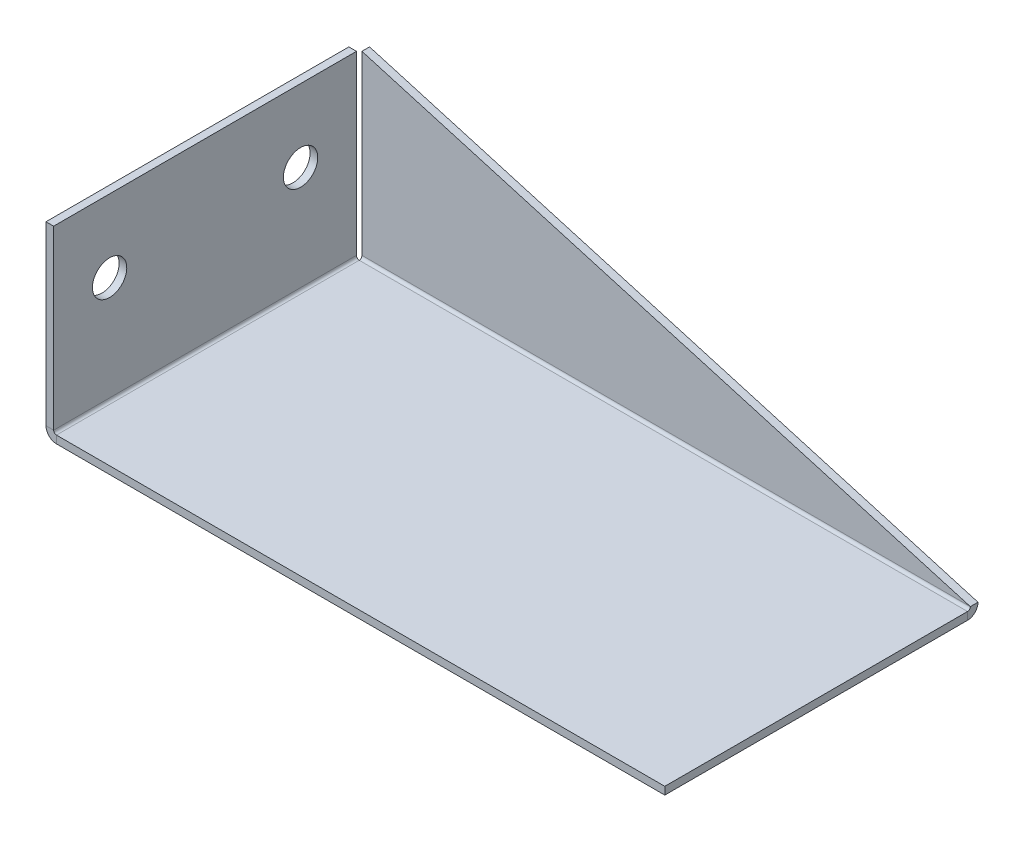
ISO-10303-21;
HEADER;
FILE_DESCRIPTION(('STEP AP214'),'2;1');
FILE_NAME('part.step','',(''),(''),'','','');
FILE_SCHEMA(('AUTOMOTIVE_DESIGN { 1 0 10303 214 1 1 1 1 }'));
ENDSEC;
DATA;
#1=APPLICATION_CONTEXT('core data for automotive mechanical design processes');
#2=APPLICATION_PROTOCOL_DEFINITION('international standard','automotive_design',2000,#1);
#3=PRODUCT_CONTEXT('',#1,'mechanical');
#4=PRODUCT('Part','Part','',(#3));
#5=PRODUCT_RELATED_PRODUCT_CATEGORY('part','',(#4));
#6=PRODUCT_DEFINITION_FORMATION('','',#4);
#7=PRODUCT_DEFINITION_CONTEXT('part definition',#1,'design');
#8=PRODUCT_DEFINITION('design','',#6,#7);
#9=PRODUCT_DEFINITION_SHAPE('','',#8);
#10=(LENGTH_UNIT() NAMED_UNIT(*) SI_UNIT(.MILLI.,.METRE.));
#11=(NAMED_UNIT(*) PLANE_ANGLE_UNIT() SI_UNIT($,.RADIAN.));
#12=(NAMED_UNIT(*) SI_UNIT($,.STERADIAN.) SOLID_ANGLE_UNIT());
#13=UNCERTAINTY_MEASURE_WITH_UNIT(LENGTH_MEASURE(1.E-05),#10,'distance_accuracy_value','');
#14=(GEOMETRIC_REPRESENTATION_CONTEXT(3) GLOBAL_UNCERTAINTY_ASSIGNED_CONTEXT((#13)) GLOBAL_UNIT_ASSIGNED_CONTEXT((#10,
#11,#12)) REPRESENTATION_CONTEXT('',''));
#15=CARTESIAN_POINT('',(0.,0.,0.));
#16=DIRECTION('',(0.,0.,1.));
#17=DIRECTION('',(1.,0.,0.));
#18=AXIS2_PLACEMENT_3D('',#15,#16,#17);
#19=CARTESIAN_POINT('',(80.,49.,-42.0000000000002));
#20=DIRECTION('',(0.,0.,1.));
#21=DIRECTION('',(0.,-1.,0.));
#22=AXIS2_PLACEMENT_3D('',#19,#20,#21);
#23=PLANE('',#22);
#24=DIRECTION('',(0.960318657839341,-0.27890513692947,0.));
#25=VECTOR('',#24,1.);
#26=CARTESIAN_POINT('',(-79.2928932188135,49.,-42.));
#27=LINE('',#26,#25);
#28=CARTESIAN_POINT('',(-79.2928932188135,49.,-42.0000000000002));
#29=VERTEX_POINT('',#28);
#30=CARTESIAN_POINT('',(79.9999999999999,2.73659999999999,-42.));
#31=VERTEX_POINT('',#30);
#32=EDGE_CURVE('E119',#29,#31,#27,.T.);
#33=ORIENTED_EDGE('',*,*,#32,.T.);
#34=DIRECTION('',(1.,0.,0.));
#35=VECTOR('',#34,1.);
#36=CARTESIAN_POINT('',(80.,2.73660000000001,-42.));
#37=LINE('',#36,#35);
#38=CARTESIAN_POINT('',(-79.2928932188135,2.73660000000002,-42.));
#39=VERTEX_POINT('',#38);
#40=EDGE_CURVE('E144',#39,#31,#37,.T.);
#41=ORIENTED_EDGE('',*,*,#40,.F.);
#42=DIRECTION('',(0.,1.,0.));
#43=VECTOR('',#42,1.);
#44=CARTESIAN_POINT('',(-79.2928932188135,49.,-42.0000000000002));
#45=LINE('',#44,#43);
#46=EDGE_CURVE('E125',#39,#29,#45,.T.);
#47=ORIENTED_EDGE('',*,*,#46,.T.);
#48=EDGE_LOOP('',(#33,#41,#47));
#49=FACE_BOUND('',#48,.T.);
#50=ADVANCED_FACE('F32',(#49),#23,.F.);
#51=CARTESIAN_POINT('',(80.,49.,-40.0000000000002));
#52=DIRECTION('',(0.,0.,1.));
#53=DIRECTION('',(0.,-1.,0.));
#54=AXIS2_PLACEMENT_3D('',#51,#52,#53);
#55=PLANE('',#54);
#56=DIRECTION('',(-1.,0.,0.));
#57=VECTOR('',#56,1.);
#58=CARTESIAN_POINT('',(80.,2.7366,-40.));
#59=LINE('',#58,#57);
#60=CARTESIAN_POINT('',(79.9999999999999,2.73659999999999,-40.));
#61=VERTEX_POINT('',#60);
#62=CARTESIAN_POINT('',(-79.2928932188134,2.73659999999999,-40.));
#63=VERTEX_POINT('',#62);
#64=EDGE_CURVE('E133',#61,#63,#59,.T.);
#65=ORIENTED_EDGE('',*,*,#64,.F.);
#66=DIRECTION('',(0.960318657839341,-0.27890513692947,0.));
#67=VECTOR('',#66,1.);
#68=CARTESIAN_POINT('',(-79.2928932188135,49.,-40.));
#69=LINE('',#68,#67);
#70=CARTESIAN_POINT('',(-79.2928932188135,49.,-40.0000000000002));
#71=VERTEX_POINT('',#70);
#72=EDGE_CURVE('E116',#71,#61,#69,.T.);
#73=ORIENTED_EDGE('',*,*,#72,.F.);
#74=DIRECTION('',(0.,1.,0.));
#75=VECTOR('',#74,1.);
#76=CARTESIAN_POINT('',(-79.2928932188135,2.,-40.));
#77=LINE('',#76,#75);
#78=EDGE_CURVE('E131',#63,#71,#77,.T.);
#79=ORIENTED_EDGE('',*,*,#78,.F.);
#80=EDGE_LOOP('',(#65,#73,#79));
#81=FACE_BOUND('',#80,.T.);
#82=ADVANCED_FACE('F130',(#81),#55,.T.);
#83=CARTESIAN_POINT('',(-80.,2.,40.));
#84=DIRECTION('',(0.,1.,0.));
#85=DIRECTION('',(0.,0.,1.));
#86=AXIS2_PLACEMENT_3D('',#83,#84,#85);
#87=PLANE('',#86);
#88=DIRECTION('',(0.,0.,-1.));
#89=VECTOR('',#88,1.);
#90=CARTESIAN_POINT('',(80.,2.,-40.));
#91=LINE('',#90,#89);
#92=CARTESIAN_POINT('',(80.,2.,40.));
#93=VERTEX_POINT('',#92);
#94=CARTESIAN_POINT('',(79.9999999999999,2.,-39.2634));
#95=VERTEX_POINT('',#94);
#96=EDGE_CURVE('E40',#93,#95,#91,.T.);
#97=ORIENTED_EDGE('',*,*,#96,.T.);
#98=DIRECTION('',(-1.,0.,0.));
#99=VECTOR('',#98,1.);
#100=CARTESIAN_POINT('',(-79.2928932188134,2.,-39.2634));
#101=LINE('',#100,#99);
#102=CARTESIAN_POINT('',(-79.2634,2.,-39.2634));
#103=VERTEX_POINT('',#102);
#104=EDGE_CURVE('E154',#103,#95,#101,.F.);
#105=ORIENTED_EDGE('',*,*,#104,.F.);
#106=DIRECTION('',(0.,0.,1.));
#107=VECTOR('',#106,1.);
#108=CARTESIAN_POINT('',(-79.2634,1.99999999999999,40.));
#109=LINE('',#108,#107);
#110=CARTESIAN_POINT('',(-79.2634,2.,40.));
#111=VERTEX_POINT('',#110);
#112=EDGE_CURVE('E47',#111,#103,#109,.F.);
#113=ORIENTED_EDGE('',*,*,#112,.F.);
#114=DIRECTION('',(1.,0.,0.));
#115=VECTOR('',#114,1.);
#116=CARTESIAN_POINT('',(-80.,2.,40.));
#117=LINE('',#116,#115);
#118=EDGE_CURVE('E51',#111,#93,#117,.T.);
#119=ORIENTED_EDGE('',*,*,#118,.T.);
#120=EDGE_LOOP('',(#97,#105,#113,#119));
#121=FACE_BOUND('',#120,.T.);
#122=ADVANCED_FACE('F265',(#121),#87,.T.);
#123=CARTESIAN_POINT('',(-80.,0.,40.));
#124=DIRECTION('',(0.,1.,0.));
#125=DIRECTION('',(0.,0.,1.));
#126=AXIS2_PLACEMENT_3D('',#123,#124,#125);
#127=PLANE('',#126);
#128=DIRECTION('',(-1.,0.,0.));
#129=VECTOR('',#128,1.);
#130=CARTESIAN_POINT('',(-79.2928932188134,0.,-39.2634));
#131=LINE('',#130,#129);
#132=CARTESIAN_POINT('',(-79.2634,0.,-39.2634));
#133=VERTEX_POINT('',#132);
#134=CARTESIAN_POINT('',(79.9999999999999,0.,-39.2634));
#135=VERTEX_POINT('',#134);
#136=EDGE_CURVE('E159',#133,#135,#131,.F.);
#137=ORIENTED_EDGE('',*,*,#136,.T.);
#138=DIRECTION('',(0.,0.,-1.));
#139=VECTOR('',#138,1.);
#140=CARTESIAN_POINT('',(80.,0.,-40.));
#141=LINE('',#140,#139);
#142=CARTESIAN_POINT('',(80.,0.,40.));
#143=VERTEX_POINT('',#142);
#144=EDGE_CURVE('E260',#143,#135,#141,.T.);
#145=ORIENTED_EDGE('',*,*,#144,.F.);
#146=DIRECTION('',(1.,0.,0.));
#147=VECTOR('',#146,1.);
#148=CARTESIAN_POINT('',(-80.,0.,40.));
#149=LINE('',#148,#147);
#150=CARTESIAN_POINT('',(-79.2633999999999,0.,40.));
#151=VERTEX_POINT('',#150);
#152=EDGE_CURVE('E258',#151,#143,#149,.T.);
#153=ORIENTED_EDGE('',*,*,#152,.F.);
#154=DIRECTION('',(0.,0.,1.));
#155=VECTOR('',#154,1.);
#156=CARTESIAN_POINT('',(-79.2633999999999,0.,40.));
#157=LINE('',#156,#155);
#158=EDGE_CURVE('E235',#151,#133,#157,.F.);
#159=ORIENTED_EDGE('',*,*,#158,.T.);
#160=EDGE_LOOP('',(#137,#145,#153,#159));
#161=FACE_BOUND('',#160,.T.);
#162=ADVANCED_FACE('F283',(#161),#127,.F.);
#163=CARTESIAN_POINT('',(80.,2.,-40.));
#164=DIRECTION('',(-1.,0.,0.));
#165=DIRECTION('',(0.,0.,1.));
#166=AXIS2_PLACEMENT_3D('',#163,#164,#165);
#167=PLANE('',#166);
#168=DIRECTION('',(0.,-1.,0.));
#169=VECTOR('',#168,1.);
#170=CARTESIAN_POINT('',(79.9999999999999,2.,-39.2634));
#171=LINE('',#170,#169);
#172=EDGE_CURVE('E158',#95,#135,#171,.T.);
#173=ORIENTED_EDGE('',*,*,#172,.F.);
#174=ORIENTED_EDGE('',*,*,#96,.F.);
#175=DIRECTION('',(0.,-1.,0.));
#176=VECTOR('',#175,1.);
#177=CARTESIAN_POINT('',(80.,2.,40.));
#178=LINE('',#177,#176);
#179=EDGE_CURVE('E11',#93,#143,#178,.T.);
#180=ORIENTED_EDGE('',*,*,#179,.T.);
#181=ORIENTED_EDGE('',*,*,#144,.T.);
#182=EDGE_LOOP('',(#173,#174,#180,#181));
#183=FACE_BOUND('',#182,.T.);
#184=ADVANCED_FACE('F337',(#183),#167,.F.);
#185=CARTESIAN_POINT('',(-80.,2.,40.));
#186=DIRECTION('',(0.,0.,-1.));
#187=DIRECTION('',(-1.,0.,0.));
#188=AXIS2_PLACEMENT_3D('',#185,#186,#187);
#189=PLANE('',#188);
#190=DIRECTION('',(0.,-1.,0.));
#191=VECTOR('',#190,1.);
#192=CARTESIAN_POINT('',(-79.2634,1.99999999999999,40.));
#193=LINE('',#192,#191);
#194=EDGE_CURVE('E247',#111,#151,#193,.T.);
#195=ORIENTED_EDGE('',*,*,#194,.T.);
#196=ORIENTED_EDGE('',*,*,#152,.T.);
#197=ORIENTED_EDGE('',*,*,#179,.F.);
#198=ORIENTED_EDGE('',*,*,#118,.F.);
#199=EDGE_LOOP('',(#195,#196,#197,#198));
#200=FACE_BOUND('',#199,.T.);
#201=ADVANCED_FACE('F34',(#200),#189,.F.);
#202=CARTESIAN_POINT('',(-79.2634,-0.0200000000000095,-39.2634));
#203=CARTESIAN_POINT('',(-79.6243031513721,-0.0200000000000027,-39.2658582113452));
#204=CARTESIAN_POINT('',(-79.9849342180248,0.0517469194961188,-39.2683155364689));
#205=CARTESIAN_POINT('',(-80.6516760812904,0.327920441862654,-39.2732310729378));
#206=CARTESIAN_POINT('',(-80.9574594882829,0.532238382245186,-39.2756888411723));
#207=CARTESIAN_POINT('',(-81.4677616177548,1.04254051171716,-39.2806043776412));
#208=CARTESIAN_POINT('',(-81.6720795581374,1.34832391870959,-39.2830621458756));
#209=CARTESIAN_POINT('',(-81.9482530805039,2.01506578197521,-39.2879776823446));
#210=CARTESIAN_POINT('',(-82.02,2.37569684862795,-39.2904350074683));
#211=CARTESIAN_POINT('',(-82.02,2.7366,-39.2928932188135));
#212=CARTESIAN_POINT('',(-79.2634,0.,-39.2634));
#213=CARTESIAN_POINT('',(-79.6216846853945,0.,-39.2658582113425));
#214=CARTESIAN_POINT('',(-79.9796992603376,0.0712263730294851,-39.2683155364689));
#215=CARTESIAN_POINT('',(-80.641603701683,0.345396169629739,-39.2732310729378));
#216=CARTESIAN_POINT('',(-80.9451685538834,0.548231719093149,-39.2756888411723));
#217=CARTESIAN_POINT('',(-81.4517682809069,1.05483144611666,-39.2806043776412));
#218=CARTESIAN_POINT('',(-81.6546038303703,1.358396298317,-39.2830621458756));
#219=CARTESIAN_POINT('',(-81.9287736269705,2.0203007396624,-39.2879776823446));
#220=CARTESIAN_POINT('',(-82.,2.37831531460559,-39.2904350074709));
#221=CARTESIAN_POINT('',(-82.,2.7366,-39.2928932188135));
#222=CARTESIAN_POINT('',(-79.2634,1.99999999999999,-39.2634));
#223=CARTESIAN_POINT('',(-79.3598380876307,1.99999999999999,-39.2658582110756));
#224=CARTESIAN_POINT('',(-79.456203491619,2.01917172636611,-39.2683155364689));
#225=CARTESIAN_POINT('',(-79.6343657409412,2.09296894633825,-39.2732310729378));
#226=CARTESIAN_POINT('',(-79.7160751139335,2.1475654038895,-39.2756888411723));
#227=CARTESIAN_POINT('',(-79.8524345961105,2.28392488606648,-39.2806043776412));
#228=CARTESIAN_POINT('',(-79.9070310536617,2.3656342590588,-39.2830621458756));
#229=CARTESIAN_POINT('',(-79.9808282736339,2.54379650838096,-39.2879776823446));
#230=CARTESIAN_POINT('',(-80.,2.64016191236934,-39.2904350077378));
#231=CARTESIAN_POINT('',(-80.,2.73660000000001,-39.2928932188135));
#232=CARTESIAN_POINT('',(-79.2634,2.02019999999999,-39.2634));
#233=CARTESIAN_POINT('',(-79.3571934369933,2.02019999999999,-39.265858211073));
#234=CARTESIAN_POINT('',(-79.450916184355,2.03884597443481,-39.2683155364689));
#235=CARTESIAN_POINT('',(-79.6241926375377,2.11061943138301,-39.2732310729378));
#236=CARTESIAN_POINT('',(-79.70366127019,2.16371867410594,-39.2756888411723));
#237=CARTESIAN_POINT('',(-79.8362813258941,2.29633872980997,-39.2806043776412));
#238=CARTESIAN_POINT('',(-79.889380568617,2.37580736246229,-39.2830621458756));
#239=CARTESIAN_POINT('',(-79.9611540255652,2.54908381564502,-39.2879776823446));
#240=CARTESIAN_POINT('',(-79.9798,2.64280656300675,-39.2904350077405));
#241=CARTESIAN_POINT('',(-79.9798,2.73660000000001,-39.2928932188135));
#242=B_SPLINE_SURFACE_WITH_KNOTS('',1,3,((#202,#203,#204,#205,#206,#207,#208,#209,#210,#211),
(#212,#213,#214,#215,#216,#217,#218,#219,#220,#221),(#222,#223,#224,#225,#226,#227,#228,#229,
#230,#231),(#232,#233,#234,#235,#236,#237,#238,#239,#240,#241)),.UNSPECIFIED.,.F.,.F.,.F.,(2,1,
1,2),(4,2,2,2,4),(-0.01,0.,1.,1.0101),(0.,0.25,0.5,0.75,1.),.UNSPECIFIED.);
#243=DIRECTION('',(1.,0.,0.));
#244=VECTOR('',#243,1.);
#245=CARTESIAN_POINT('',(-80.,2.73660000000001,-39.2928932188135));
#246=LINE('',#245,#244);
#247=CARTESIAN_POINT('',(-82.,2.7366,-39.2928932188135));
#248=VERTEX_POINT('',#247);
#249=CARTESIAN_POINT('',(-80.,2.73660000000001,-39.2928932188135));
#250=VERTEX_POINT('',#249);
#251=EDGE_CURVE('E298',#248,#250,#246,.T.);
#252=CARTESIAN_POINT('',(-79.2634,1.99999999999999,-39.2634));
#253=CARTESIAN_POINT('',(-79.275452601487,1.9999997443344,-39.2637072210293));
#254=CARTESIAN_POINT('',(-79.2875051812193,2.0002958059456,-39.2640144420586));
#255=CARTESIAN_POINT('',(-79.3115813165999,2.00147872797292,-39.2646288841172));
#256=CARTESIAN_POINT('',(-79.323604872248,2.00236558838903,-39.2649361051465));
#257=CARTESIAN_POINT('',(-79.3475939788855,2.00472827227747,-39.2655505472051));
#258=CARTESIAN_POINT('',(-79.3595595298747,2.00620409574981,-39.2658577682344));
#259=CARTESIAN_POINT('',(-79.383403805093,2.00974106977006,-39.2664722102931));
#260=CARTESIAN_POINT('',(-79.3952825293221,2.01180222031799,-39.2667794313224));
#261=CARTESIAN_POINT('',(-79.4189245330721,2.01650490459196,-39.267393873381));
#262=CARTESIAN_POINT('',(-79.4306878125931,2.019146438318,-39.2677010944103));
#263=CARTESIAN_POINT('',(-79.4540705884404,2.02500351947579,-39.2683155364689));
#264=CARTESIAN_POINT('',(-79.4656900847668,2.02821906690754,-39.2686227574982));
#265=CARTESIAN_POINT('',(-79.4887573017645,2.03521643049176,-39.2692371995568));
#266=CARTESIAN_POINT('',(-79.5002050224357,2.03899824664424,-39.2695444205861));
#267=CARTESIAN_POINT('',(-79.5229011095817,2.04711903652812,-39.2701588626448));
#268=CARTESIAN_POINT('',(-79.5341494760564,2.05145801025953,-39.2704660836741));
#269=CARTESIAN_POINT('',(-79.5564197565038,2.06068266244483,-39.2710805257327));
#270=CARTESIAN_POINT('',(-79.5674416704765,2.06556834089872,-39.271387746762));
#271=CARTESIAN_POINT('',(-79.589232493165,2.07587463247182,-39.2720021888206));
#272=CARTESIAN_POINT('',(-79.6000014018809,2.08129524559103,-39.2723094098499));
#273=CARTESIAN_POINT('',(-79.6212602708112,2.09265834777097,-39.2729238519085));
#274=CARTESIAN_POINT('',(-79.6317502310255,2.0986008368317,-39.2732310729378));
#275=CARTESIAN_POINT('',(-79.6524259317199,2.11099337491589,-39.2738455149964));
#276=CARTESIAN_POINT('',(-79.6626116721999,2.11744342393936,-39.2741527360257));
#277=CARTESIAN_POINT('',(-79.6826543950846,2.13083554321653,-39.2747671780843));
#278=CARTESIAN_POINT('',(-79.6925113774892,2.13777761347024,-39.2750743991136));
#279=CARTESIAN_POINT('',(-79.7118728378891,2.15213705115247,-39.2756888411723));
#280=CARTESIAN_POINT('',(-79.7213773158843,2.15955441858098,-39.2759960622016));
#281=CARTESIAN_POINT('',(-79.7400108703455,2.17484658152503,-39.2766105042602));
#282=CARTESIAN_POINT('',(-79.7491399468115,2.18272137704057,-39.2769177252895));
#283=CARTESIAN_POINT('',(-79.7670007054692,2.1989094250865,-39.2775321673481));
#284=CARTESIAN_POINT('',(-79.7757323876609,2.2072226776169,-39.2778393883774));
#285=CARTESIAN_POINT('',(-79.7927773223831,2.22426761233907,-39.278453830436));
#286=CARTESIAN_POINT('',(-79.8010905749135,2.23299929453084,-39.2787610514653));
#287=CARTESIAN_POINT('',(-79.8172786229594,2.25086005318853,-39.279375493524));
#288=CARTESIAN_POINT('',(-79.825153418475,2.25998912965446,-39.2796827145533));
#289=CARTESIAN_POINT('',(-79.840445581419,2.27862268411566,-39.2802971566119));
#290=CARTESIAN_POINT('',(-79.8478629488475,2.28812716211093,-39.2806043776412));
#291=CARTESIAN_POINT('',(-79.8622223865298,2.30748862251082,-39.2812188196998));
#292=CARTESIAN_POINT('',(-79.8691644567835,2.31734560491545,-39.2815260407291));
#293=CARTESIAN_POINT('',(-79.8825565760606,2.33738832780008,-39.2821404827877));
#294=CARTESIAN_POINT('',(-79.8890066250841,2.34757406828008,-39.282447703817));
#295=CARTESIAN_POINT('',(-79.9013991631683,2.36824976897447,-39.2830621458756));
#296=CARTESIAN_POINT('',(-79.907341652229,2.37873972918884,-39.2833693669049));
#297=CARTESIAN_POINT('',(-79.918704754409,2.3999985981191,-39.2839838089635));
#298=CARTESIAN_POINT('',(-79.9241253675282,2.41076750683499,-39.2842910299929));
#299=CARTESIAN_POINT('',(-79.9344316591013,2.43255832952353,-39.2849054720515));
#300=CARTESIAN_POINT('',(-79.9393173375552,2.44358024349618,-39.2852126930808));
#301=CARTESIAN_POINT('',(-79.9485419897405,2.46585052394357,-39.2858271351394));
#302=CARTESIAN_POINT('',(-79.9528809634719,2.4770988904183,-39.2861343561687));
#303=CARTESIAN_POINT('',(-79.9610017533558,2.49979497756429,-39.2867487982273));
#304=CARTESIAN_POINT('',(-79.9647835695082,2.51124269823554,-39.2870560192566));
#305=CARTESIAN_POINT('',(-79.9717809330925,2.53430991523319,-39.2876704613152));
#306=CARTESIAN_POINT('',(-79.9749964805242,2.54592941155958,-39.2879776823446));
#307=CARTESIAN_POINT('',(-79.980853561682,2.56931218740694,-39.2885921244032));
#308=CARTESIAN_POINT('',(-79.983495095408,2.5810754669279,-39.2888993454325));
#309=CARTESIAN_POINT('',(-79.988197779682,2.60471747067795,-39.2895137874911));
#310=CARTESIAN_POINT('',(-79.9902589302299,2.61659619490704,-39.2898210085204));
#311=CARTESIAN_POINT('',(-79.9937959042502,2.64044047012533,-39.290435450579));
#312=CARTESIAN_POINT('',(-79.9952717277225,2.65240602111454,-39.2907426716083));
#313=CARTESIAN_POINT('',(-79.997634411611,2.67639512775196,-39.2913571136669));
#314=CARTESIAN_POINT('',(-79.9985212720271,2.68841868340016,-39.2916643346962));
#315=CARTESIAN_POINT('',(-79.9997041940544,2.7124948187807,-39.2922787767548));
#316=CARTESIAN_POINT('',(-80.0000002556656,2.72454739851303,-39.2925859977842));
#317=CARTESIAN_POINT('',(-80.,2.73660000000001,-39.2928932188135));
#318=B_SPLINE_CURVE_WITH_KNOTS('',3,(#252,#253,#254,#255,#256,#257,#258,#259,#260,#261,#262,
#263,#264,#265,#266,#267,#268,#269,#270,#271,#272,#273,#274,#275,#276,#277,#278,#279,#280,#281,
#282,#283,#284,#285,#286,#287,#288,#289,#290,#291,#292,#293,#294,#295,#296,#297,#298,#299,#300,
#301,#302,#303,#304,#305,#306,#307,#308,#309,#310,#311,#312,#313,#314,#315,#316,#317),
.UNSPECIFIED.,.F.,.F.,(4,2,2,2,2,2,2,2,2,2,2,2,2,2,2,2,2,2,2,2,2,2,2,2,2,2,2,2,2,2,2,2,4),(0.,
0.0361658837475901,0.0723317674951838,0.108497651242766,0.144663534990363,0.18082941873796,
0.216995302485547,0.253161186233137,0.28932706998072,0.325492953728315,0.361658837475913,
0.397824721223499,0.433990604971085,0.470156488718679,0.506322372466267,0.542488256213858,
0.578654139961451,0.614820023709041,0.650985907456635,0.687151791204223,0.723317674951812,
0.759483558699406,0.795649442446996,0.831815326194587,0.867981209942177,0.904147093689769,
0.940312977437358,0.976478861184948,1.01264474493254,1.04881062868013,1.08497651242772,
1.12114239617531,1.1573082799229),.UNSPECIFIED.);
#319=EDGE_CURVE('E228',#103,#250,#318,.T.);
#320=DIRECTION('',(0.,-1.,0.));
#321=VECTOR('',#320,1.);
#322=CARTESIAN_POINT('',(-79.2634,1.99999999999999,-39.2634));
#323=LINE('',#322,#321);
#324=EDGE_CURVE('E255',#103,#133,#323,.T.);
#325=CARTESIAN_POINT('',(-79.2634,0.,-39.2634));
#326=CARTESIAN_POINT('',(-79.3081775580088,-9.49843149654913E-07,-39.2637072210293));
#327=CARTESIAN_POINT('',(-79.3529550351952,0.00109897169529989,-39.2640144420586));
#328=CARTESIAN_POINT('',(-79.4424021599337,0.00549373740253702,-39.2646288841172));
#329=CARTESIAN_POINT('',(-79.4870718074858,0.00878858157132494,-39.2649361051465));
#330=CARTESIAN_POINT('',(-79.576195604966,0.017566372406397,-39.2655505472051));
#331=CARTESIAN_POINT('',(-79.6206497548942,0.0230493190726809,-39.2658577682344));
#332=CARTESIAN_POINT('',(-79.709235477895,0.0361898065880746,-39.2664722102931));
#333=CARTESIAN_POINT('',(-79.7533670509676,0.0438473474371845,-39.2667794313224));
#334=CARTESIAN_POINT('',(-79.8412012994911,0.061318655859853,-39.267393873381));
#335=CARTESIAN_POINT('',(-79.8849039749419,0.0711324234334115,-39.2677010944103));
#336=CARTESIAN_POINT('',(-79.9717751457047,0.0928925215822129,-39.2683155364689));
#337=CARTESIAN_POINT('',(-80.0149436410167,0.104838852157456,-39.2686227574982));
#338=CARTESIAN_POINT('',(-80.1006424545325,0.130835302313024,-39.2692371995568));
#339=CARTESIAN_POINT('',(-80.1431727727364,0.14488542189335,-39.2695444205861));
#340=CARTESIAN_POINT('',(-80.22749277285,0.175055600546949,-39.2701588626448));
#341=CARTESIAN_POINT('',(-80.2692824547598,0.191175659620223,-39.2704660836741));
#342=CARTESIAN_POINT('',(-80.3520205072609,0.225446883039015,-39.2710805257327));
#343=CARTESIAN_POINT('',(-80.3929688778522,0.243598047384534,-39.271387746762));
#344=CARTESIAN_POINT('',(-80.4739256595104,0.281887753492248,-39.2720021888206));
#345=CARTESIAN_POINT('',(-80.5139340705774,0.302026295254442,-39.2723094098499));
#346=CARTESIAN_POINT('',(-80.5929145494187,0.344242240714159,-39.2729238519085));
#347=CARTESIAN_POINT('',(-80.6318866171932,0.366319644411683,-39.2732310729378));
#348=CARTESIAN_POINT('',(-80.7087005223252,0.412360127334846,-39.2738455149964));
#349=CARTESIAN_POINT('',(-80.7465423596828,0.436323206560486,-39.2741527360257));
#350=CARTESIAN_POINT('',(-80.8210046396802,0.486077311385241,-39.2747671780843));
#351=CARTESIAN_POINT('',(-80.85762508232,0.511868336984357,-39.2750743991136));
#352=CARTESIAN_POINT('',(-80.929556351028,0.565216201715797,-39.2756888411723));
#353=CARTESIAN_POINT('',(-80.9648671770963,0.592773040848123,-39.2759960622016));
#354=CARTESIAN_POINT('',(-81.0340941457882,0.649586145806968,-39.2766105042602));
#355=CARTESIAN_POINT('',(-81.068010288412,0.678842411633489,-39.2769177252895));
#356=CARTESIAN_POINT('',(-81.1343661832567,0.738983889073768,-39.2775321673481));
#357=CARTESIAN_POINT('',(-81.1668059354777,0.769869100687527,-39.2778393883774));
#358=CARTESIAN_POINT('',(-81.2301308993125,0.833194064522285,-39.278453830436));
#359=CARTESIAN_POINT('',(-81.2610161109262,0.865633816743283,-39.2787610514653));
#360=CARTESIAN_POINT('',(-81.3211575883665,0.931989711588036,-39.279375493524));
#361=CARTESIAN_POINT('',(-81.3504138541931,0.965905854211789,-39.2796827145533));
#362=CARTESIAN_POINT('',(-81.4072269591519,1.03513282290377,-39.2802971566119));
#363=CARTESIAN_POINT('',(-81.4347837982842,1.07044364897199,-39.2806043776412));
#364=CARTESIAN_POINT('',(-81.4881316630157,1.14237491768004,-39.2812188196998));
#365=CARTESIAN_POINT('',(-81.5139226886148,1.17899536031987,-39.2815260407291));
#366=CARTESIAN_POINT('',(-81.5636767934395,1.25345764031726,-39.2821404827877));
#367=CARTESIAN_POINT('',(-81.5876398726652,1.29129947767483,-39.282447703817));
#368=CARTESIAN_POINT('',(-81.6336803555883,1.36811338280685,-39.2830621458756));
#369=CARTESIAN_POINT('',(-81.6557577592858,1.4070854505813,-39.2833693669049));
#370=CARTESIAN_POINT('',(-81.6979737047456,1.48606592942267,-39.2839838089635));
#371=CARTESIAN_POINT('',(-81.7181122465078,1.52607434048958,-39.2842910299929));
#372=CARTESIAN_POINT('',(-81.7564019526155,1.60703112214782,-39.2849054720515));
#373=CARTESIAN_POINT('',(-81.774553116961,1.64797949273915,-39.2852126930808));
#374=CARTESIAN_POINT('',(-81.8088243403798,1.73071754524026,-39.2858271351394));
#375=CARTESIAN_POINT('',(-81.8249443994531,1.77250722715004,-39.2861343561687));
#376=CARTESIAN_POINT('',(-81.8551145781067,1.85682722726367,-39.2867487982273));
#377=CARTESIAN_POINT('',(-81.869164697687,1.89935754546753,-39.2870560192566));
#378=CARTESIAN_POINT('',(-81.8951611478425,1.98505635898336,-39.2876704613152));
#379=CARTESIAN_POINT('',(-81.9071074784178,2.02822485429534,-39.2879776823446));
#380=CARTESIAN_POINT('',(-81.9288675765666,2.11509602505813,-39.2885921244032));
#381=CARTESIAN_POINT('',(-81.9386813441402,2.15879870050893,-39.2888993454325));
#382=CARTESIAN_POINT('',(-81.9561526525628,2.2466329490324,-39.2895137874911));
#383=CARTESIAN_POINT('',(-81.9638101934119,2.29076452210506,-39.2898210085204));
#384=CARTESIAN_POINT('',(-81.9769506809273,2.37935024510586,-39.290435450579));
#385=CARTESIAN_POINT('',(-81.9824336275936,2.42380439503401,-39.2907426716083));
#386=CARTESIAN_POINT('',(-81.9912114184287,2.51292819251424,-39.2913571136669));
#387=CARTESIAN_POINT('',(-81.9945062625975,2.55759784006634,-39.2916643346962));
#388=CARTESIAN_POINT('',(-81.9989010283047,2.64704496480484,-39.2922787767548));
#389=CARTESIAN_POINT('',(-82.0000009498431,2.69182244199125,-39.2925859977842));
#390=CARTESIAN_POINT('',(-82.,2.7366,-39.2928932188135));
#391=B_SPLINE_CURVE_WITH_KNOTS('',3,(#325,#326,#327,#328,#329,#330,#331,#332,#333,#334,#335,
#336,#337,#338,#339,#340,#341,#342,#343,#344,#345,#346,#347,#348,#349,#350,#351,#352,#353,#354,
#355,#356,#357,#358,#359,#360,#361,#362,#363,#364,#365,#366,#367,#368,#369,#370,#371,#372,#373,
#374,#375,#376,#377,#378,#379,#380,#381,#382,#383,#384,#385,#386,#387,#388,#389,#390),
.UNSPECIFIED.,.F.,.F.,(4,2,2,2,2,2,2,2,2,2,2,2,2,2,2,2,2,2,2,2,2,2,2,2,2,2,2,2,2,2,2,2,4),(0.,
0.134322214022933,0.268644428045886,0.402966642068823,0.537288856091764,0.671611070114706,
0.805933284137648,0.940255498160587,1.07457771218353,1.20889992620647,1.34322214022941,
1.47754435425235,1.6118665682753,1.74618878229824,1.88051099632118,2.01483321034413,
2.14915542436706,2.28347763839,2.41779985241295,2.55212206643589,2.68644428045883,
2.82076649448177,2.95508870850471,3.08941092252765,3.22373313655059,3.35805535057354,
3.49237756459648,3.62669977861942,3.76102199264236,3.8953442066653,4.02966642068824,
4.16398863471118,4.29831084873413),.UNSPECIFIED.);
#392=EDGE_CURVE('E243',#133,#248,#391,.T.);
#393=ORIENTED_EDGE('',*,*,#251,.T.);
#394=ORIENTED_EDGE('',*,*,#319,.F.);
#395=ORIENTED_EDGE('',*,*,#324,.T.);
#396=ORIENTED_EDGE('',*,*,#392,.T.);
#397=EDGE_LOOP('',(#393,#394,#395,#396));
#398=FACE_BOUND('',#397,.T.);
#399=ADVANCED_FACE('F279',(#398),#242,.F.);
#400=CARTESIAN_POINT('',(-79.2634,2.73660000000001,40.));
#401=DIRECTION('',(0.,0.,-1.));
#402=DIRECTION('',(-1.,0.,0.));
#403=AXIS2_PLACEMENT_3D('',#400,#401,#402);
#404=PLANE('',#403);
#405=CARTESIAN_POINT('',(-79.2634,2.73660000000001,40.));
#406=DIRECTION('',(0.,0.,1.));
#407=DIRECTION('',(1.,0.,0.));
#408=AXIS2_PLACEMENT_3D('',#405,#406,#407);
#409=CIRCLE('',#408,0.736600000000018);
#410=CARTESIAN_POINT('',(-80.,2.73660000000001,40.));
#411=VERTEX_POINT('',#410);
#412=EDGE_CURVE('E296',#411,#111,#409,.T.);
#413=ORIENTED_EDGE('',*,*,#412,.F.);
#414=DIRECTION('',(-1.,0.,0.));
#415=VECTOR('',#414,1.);
#416=CARTESIAN_POINT('',(-80.,2.73660000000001,40.));
#417=LINE('',#416,#415);
#418=CARTESIAN_POINT('',(-82.,2.7366,40.));
#419=VERTEX_POINT('',#418);
#420=EDGE_CURVE('E293',#411,#419,#417,.T.);
#421=ORIENTED_EDGE('',*,*,#420,.T.);
#422=CARTESIAN_POINT('',(-79.2634,2.73660000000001,40.));
#423=DIRECTION('',(0.,0.,1.));
#424=DIRECTION('',(1.,0.,0.));
#425=AXIS2_PLACEMENT_3D('',#422,#423,#424);
#426=CIRCLE('',#425,2.73660000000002);
#427=EDGE_CURVE('E233',#419,#151,#426,.T.);
#428=ORIENTED_EDGE('',*,*,#427,.T.);
#429=ORIENTED_EDGE('',*,*,#194,.F.);
#430=EDGE_LOOP('',(#413,#421,#428,#429));
#431=FACE_BOUND('',#430,.T.);
#432=ADVANCED_FACE('F224',(#431),#404,.F.);
#433=CARTESIAN_POINT('',(-79.2634,2.73660000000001,40.));
#434=DIRECTION('',(0.,0.,1.));
#435=DIRECTION('',(-1.,0.,0.));
#436=AXIS2_PLACEMENT_3D('',#433,#434,#435);
#437=CYLINDRICAL_SURFACE('',#436,2.73660000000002);
#438=ORIENTED_EDGE('',*,*,#158,.F.);
#439=ORIENTED_EDGE('',*,*,#427,.F.);
#440=DIRECTION('',(0.,0.,-1.));
#441=VECTOR('',#440,1.);
#442=CARTESIAN_POINT('',(-82.,2.7366,-40.));
#443=LINE('',#442,#441);
#444=EDGE_CURVE('E313',#419,#248,#443,.T.);
#445=ORIENTED_EDGE('',*,*,#444,.T.);
#446=ORIENTED_EDGE('',*,*,#392,.F.);
#447=EDGE_LOOP('',(#438,#439,#445,#446));
#448=FACE_BOUND('',#447,.T.);
#449=ADVANCED_FACE('F222',(#448),#437,.T.);
#450=CARTESIAN_POINT('',(-79.2634,2.73660000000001,40.));
#451=DIRECTION('',(0.,0.,1.));
#452=DIRECTION('',(-1.,0.,0.));
#453=AXIS2_PLACEMENT_3D('',#450,#451,#452);
#454=CYLINDRICAL_SURFACE('',#453,0.736600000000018);
#455=ORIENTED_EDGE('',*,*,#112,.T.);
#456=ORIENTED_EDGE('',*,*,#319,.T.);
#457=DIRECTION('',(0.,0.,1.));
#458=VECTOR('',#457,1.);
#459=CARTESIAN_POINT('',(-80.,2.73660000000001,-40.));
#460=LINE('',#459,#458);
#461=EDGE_CURVE('E316',#250,#411,#460,.T.);
#462=ORIENTED_EDGE('',*,*,#461,.T.);
#463=ORIENTED_EDGE('',*,*,#412,.T.);
#464=EDGE_LOOP('',(#455,#456,#462,#463));
#465=FACE_BOUND('',#464,.T.);
#466=ADVANCED_FACE('F203',(#465),#454,.F.);
#467=CARTESIAN_POINT('',(-80.,2.,-39.2928932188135));
#468=DIRECTION('',(0.,0.,-1.));
#469=DIRECTION('',(0.,1.,0.));
#470=AXIS2_PLACEMENT_3D('',#467,#468,#469);
#471=PLANE('',#470);
#472=DIRECTION('',(0.,1.,0.));
#473=VECTOR('',#472,1.);
#474=CARTESIAN_POINT('',(-82.0000000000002,49.,-39.2928932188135));
#475=LINE('',#474,#473);
#476=CARTESIAN_POINT('',(-82.0000000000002,49.,-39.2928932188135));
#477=VERTEX_POINT('',#476);
#478=EDGE_CURVE('E320',#248,#477,#475,.T.);
#479=ORIENTED_EDGE('',*,*,#478,.T.);
#480=DIRECTION('',(1.,0.,0.));
#481=VECTOR('',#480,1.);
#482=CARTESIAN_POINT('',(-82.0000000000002,49.,-39.2928932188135));
#483=LINE('',#482,#481);
#484=CARTESIAN_POINT('',(-80.0000000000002,49.,-39.2928932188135));
#485=VERTEX_POINT('',#484);
#486=EDGE_CURVE('E318',#477,#485,#483,.T.);
#487=ORIENTED_EDGE('',*,*,#486,.T.);
#488=DIRECTION('',(0.,1.,0.));
#489=VECTOR('',#488,1.);
#490=CARTESIAN_POINT('',(-80.,2.,-39.2928932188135));
#491=LINE('',#490,#489);
#492=EDGE_CURVE('E322',#250,#485,#491,.T.);
#493=ORIENTED_EDGE('',*,*,#492,.F.);
#494=ORIENTED_EDGE('',*,*,#251,.F.);
#495=EDGE_LOOP('',(#479,#487,#493,#494));
#496=FACE_BOUND('',#495,.T.);
#497=ADVANCED_FACE('F194',(#496),#471,.T.);
#498=CARTESIAN_POINT('',(-82.0000000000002,49.,-40.));
#499=DIRECTION('',(1.,0.,0.));
#500=DIRECTION('',(0.,1.,0.));
#501=AXIS2_PLACEMENT_3D('',#498,#499,#500);
#502=PLANE('',#501);
#503=CARTESIAN_POINT('',(-82.0000000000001,30.,-24.6464466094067));
#504=DIRECTION('',(1.,0.,0.));
#505=DIRECTION('',(0.,1.,0.));
#506=AXIS2_PLACEMENT_3D('',#503,#504,#505);
#507=CIRCLE('',#506,4.50000000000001);
#508=CARTESIAN_POINT('',(-82.0000000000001,34.5,-24.6464466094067));
#509=VERTEX_POINT('',#508);
#510=EDGE_CURVE('E369',#509,#509,#507,.T.);
#511=ORIENTED_EDGE('',*,*,#510,.T.);
#512=EDGE_LOOP('',(#511));
#513=FACE_BOUND('',#512,.T.);
#514=CARTESIAN_POINT('',(-82.0000000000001,30.,25.3535533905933));
#515=DIRECTION('',(1.,0.,0.));
#516=DIRECTION('',(0.,1.,0.));
#517=AXIS2_PLACEMENT_3D('',#514,#515,#516);
#518=CIRCLE('',#517,4.50000000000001);
#519=CARTESIAN_POINT('',(-82.0000000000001,34.5,25.3535533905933));
#520=VERTEX_POINT('',#519);
#521=EDGE_CURVE('E134',#520,#520,#518,.T.);
#522=ORIENTED_EDGE('',*,*,#521,.T.);
#523=EDGE_LOOP('',(#522));
#524=FACE_BOUND('',#523,.T.);
#525=ORIENTED_EDGE('',*,*,#478,.F.);
#526=ORIENTED_EDGE('',*,*,#444,.F.);
#527=DIRECTION('',(0.,1.,0.));
#528=VECTOR('',#527,1.);
#529=CARTESIAN_POINT('',(-82.0000000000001,49.,40.));
#530=LINE('',#529,#528);
#531=CARTESIAN_POINT('',(-82.0000000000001,49.,40.));
#532=VERTEX_POINT('',#531);
#533=EDGE_CURVE('E306',#419,#532,#530,.T.);
#534=ORIENTED_EDGE('',*,*,#533,.T.);
#535=DIRECTION('',(0.,0.,-1.));
#536=VECTOR('',#535,1.);
#537=CARTESIAN_POINT('',(-82.0000000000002,49.,-40.));
#538=LINE('',#537,#536);
#539=EDGE_CURVE('E303',#532,#477,#538,.T.);
#540=ORIENTED_EDGE('',*,*,#539,.T.);
#541=EDGE_LOOP('',(#525,#526,#534,#540));
#542=FACE_BOUND('',#541,.T.);
#543=ADVANCED_FACE('F202',(#513,#524,#542),#502,.F.);
#544=CARTESIAN_POINT('',(-80.0000000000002,49.,-40.));
#545=DIRECTION('',(1.,0.,0.));
#546=DIRECTION('',(0.,1.,0.));
#547=AXIS2_PLACEMENT_3D('',#544,#545,#546);
#548=PLANE('',#547);
#549=CARTESIAN_POINT('',(-80.0000000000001,30.,-24.6464466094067));
#550=DIRECTION('',(1.,0.,0.));
#551=DIRECTION('',(0.,1.,0.));
#552=AXIS2_PLACEMENT_3D('',#549,#550,#551);
#553=CIRCLE('',#552,4.50000000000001);
#554=CARTESIAN_POINT('',(-80.0000000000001,34.5,-24.6464466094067));
#555=VERTEX_POINT('',#554);
#556=EDGE_CURVE('E372',#555,#555,#553,.T.);
#557=ORIENTED_EDGE('',*,*,#556,.F.);
#558=EDGE_LOOP('',(#557));
#559=FACE_BOUND('',#558,.T.);
#560=CARTESIAN_POINT('',(-80.0000000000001,30.,25.3535533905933));
#561=DIRECTION('',(1.,0.,0.));
#562=DIRECTION('',(0.,1.,0.));
#563=AXIS2_PLACEMENT_3D('',#560,#561,#562);
#564=CIRCLE('',#563,4.50000000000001);
#565=CARTESIAN_POINT('',(-80.0000000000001,34.5,25.3535533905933));
#566=VERTEX_POINT('',#565);
#567=EDGE_CURVE('E374',#566,#566,#564,.T.);
#568=ORIENTED_EDGE('',*,*,#567,.F.);
#569=EDGE_LOOP('',(#568));
#570=FACE_BOUND('',#569,.T.);
#571=ORIENTED_EDGE('',*,*,#461,.F.);
#572=ORIENTED_EDGE('',*,*,#492,.T.);
#573=DIRECTION('',(0.,0.,-1.));
#574=VECTOR('',#573,1.);
#575=CARTESIAN_POINT('',(-80.0000000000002,49.,-40.));
#576=LINE('',#575,#574);
#577=CARTESIAN_POINT('',(-80.0000000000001,49.,40.));
#578=VERTEX_POINT('',#577);
#579=EDGE_CURVE('E308',#578,#485,#576,.T.);
#580=ORIENTED_EDGE('',*,*,#579,.F.);
#581=DIRECTION('',(0.,1.,0.));
#582=VECTOR('',#581,1.);
#583=CARTESIAN_POINT('',(-80.0000000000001,49.,40.));
#584=LINE('',#583,#582);
#585=EDGE_CURVE('E311',#411,#578,#584,.T.);
#586=ORIENTED_EDGE('',*,*,#585,.F.);
#587=EDGE_LOOP('',(#571,#572,#580,#586));
#588=FACE_BOUND('',#587,.T.);
#589=ADVANCED_FACE('F205',(#559,#570,#588),#548,.T.);
#590=CARTESIAN_POINT('',(-82.0000000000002,49.,-40.));
#591=DIRECTION('',(0.,-1.,0.));
#592=DIRECTION('',(1.,0.,0.));
#593=AXIS2_PLACEMENT_3D('',#590,#591,#592);
#594=PLANE('',#593);
#595=ORIENTED_EDGE('',*,*,#486,.F.);
#596=ORIENTED_EDGE('',*,*,#539,.F.);
#597=DIRECTION('',(1.,0.,0.));
#598=VECTOR('',#597,1.);
#599=CARTESIAN_POINT('',(-82.0000000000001,49.,40.));
#600=LINE('',#599,#598);
#601=EDGE_CURVE('E300',#532,#578,#600,.T.);
#602=ORIENTED_EDGE('',*,*,#601,.T.);
#603=ORIENTED_EDGE('',*,*,#579,.T.);
#604=EDGE_LOOP('',(#595,#596,#602,#603));
#605=FACE_BOUND('',#604,.T.);
#606=ADVANCED_FACE('F208',(#605),#594,.F.);
#607=CARTESIAN_POINT('',(-82.0000000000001,49.,40.));
#608=DIRECTION('',(0.,0.,-1.));
#609=DIRECTION('',(-1.,0.,0.));
#610=AXIS2_PLACEMENT_3D('',#607,#608,#609);
#611=PLANE('',#610);
#612=ORIENTED_EDGE('',*,*,#420,.F.);
#613=ORIENTED_EDGE('',*,*,#585,.T.);
#614=ORIENTED_EDGE('',*,*,#601,.F.);
#615=ORIENTED_EDGE('',*,*,#533,.F.);
#616=EDGE_LOOP('',(#612,#613,#614,#615));
#617=FACE_BOUND('',#616,.T.);
#618=ADVANCED_FACE('F187',(#617),#611,.F.);
#619=CARTESIAN_POINT('',(80.,2.7366,-39.2634));
#620=DIRECTION('',(1.,0.,0.));
#621=DIRECTION('',(0.,0.,-1.));
#622=AXIS2_PLACEMENT_3D('',#619,#620,#621);
#623=PLANE('',#622);
#624=DIRECTION('',(0.,0.,-1.));
#625=VECTOR('',#624,1.);
#626=CARTESIAN_POINT('',(80.,2.7366,-40.));
#627=LINE('',#626,#625);
#628=EDGE_CURVE('E124',#61,#31,#627,.T.);
#629=ORIENTED_EDGE('',*,*,#628,.F.);
#630=CARTESIAN_POINT('',(80.,2.7366,-39.2634));
#631=DIRECTION('',(-1.,0.,0.));
#632=DIRECTION('',(0.,0.,1.));
#633=AXIS2_PLACEMENT_3D('',#630,#631,#632);
#634=CIRCLE('',#633,0.736599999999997);
#635=EDGE_CURVE('E150',#95,#61,#634,.F.);
#636=ORIENTED_EDGE('',*,*,#635,.F.);
#637=ORIENTED_EDGE('',*,*,#172,.T.);
#638=CARTESIAN_POINT('',(79.9999999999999,2.7366,-39.2634));
#639=DIRECTION('',(-1.,0.,0.));
#640=DIRECTION('',(0.,0.,1.));
#641=AXIS2_PLACEMENT_3D('',#638,#639,#640);
#642=CIRCLE('',#641,2.7366);
#643=EDGE_CURVE('E155',#135,#31,#642,.F.);
#644=ORIENTED_EDGE('',*,*,#643,.T.);
#645=EDGE_LOOP('',(#629,#636,#637,#644));
#646=FACE_BOUND('',#645,.T.);
#647=ADVANCED_FACE('F184',(#646),#623,.T.);
#648=CARTESIAN_POINT('',(-79.2928932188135,2.73660000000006,-42.02));
#649=CARTESIAN_POINT('',(-79.2904350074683,2.375696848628,-42.02));
#650=CARTESIAN_POINT('',(-79.2879776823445,2.01506578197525,-41.9482530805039));
#651=CARTESIAN_POINT('',(-79.2830621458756,1.34832391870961,-41.6720795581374));
#652=CARTESIAN_POINT('',(-79.2806043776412,1.04254051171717,-41.4677616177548));
#653=CARTESIAN_POINT('',(-79.2756888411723,0.532238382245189,-40.9574594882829));
#654=CARTESIAN_POINT('',(-79.2732310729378,0.327920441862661,-40.6516760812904));
#655=CARTESIAN_POINT('',(-79.2683155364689,0.0517469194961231,-39.9849342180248));
#656=CARTESIAN_POINT('',(-79.2658582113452,-0.0199999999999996,-39.6243031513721));
#657=CARTESIAN_POINT('',(-79.2634,-0.0199999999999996,-39.2634));
#658=CARTESIAN_POINT('',(-79.2928932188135,2.73660000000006,-42.));
#659=CARTESIAN_POINT('',(-79.2904350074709,2.37831531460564,-42.));
#660=CARTESIAN_POINT('',(-79.2879776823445,2.02030073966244,-41.9287736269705));
#661=CARTESIAN_POINT('',(-79.2830621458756,1.35839629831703,-41.6546038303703));
#662=CARTESIAN_POINT('',(-79.2806043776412,1.05483144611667,-41.4517682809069));
#663=CARTESIAN_POINT('',(-79.2756888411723,0.548231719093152,-40.9451685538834));
#664=CARTESIAN_POINT('',(-79.2732310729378,0.345396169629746,-40.641603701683));
#665=CARTESIAN_POINT('',(-79.2683155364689,0.0712263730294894,-39.9796992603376));
#666=CARTESIAN_POINT('',(-79.2658582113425,0.,-39.6216846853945));
#667=CARTESIAN_POINT('',(-79.2634,0.,-39.2634));
#668=CARTESIAN_POINT('',(-79.2928932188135,2.73660000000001,-40.));
#669=CARTESIAN_POINT('',(-79.2904350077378,2.64016191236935,-40.));
#670=CARTESIAN_POINT('',(-79.2879776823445,2.54379650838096,-39.9808282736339));
#671=CARTESIAN_POINT('',(-79.2830621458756,2.3656342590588,-39.9070310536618));
#672=CARTESIAN_POINT('',(-79.2806043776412,2.28392488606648,-39.8524345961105));
#673=CARTESIAN_POINT('',(-79.2756888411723,2.1475654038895,-39.7160751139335));
#674=CARTESIAN_POINT('',(-79.2732310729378,2.09296894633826,-39.6343657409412));
#675=CARTESIAN_POINT('',(-79.2683155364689,2.01917172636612,-39.456203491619));
#676=CARTESIAN_POINT('',(-79.2658582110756,2.,-39.3598380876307));
#677=CARTESIAN_POINT('',(-79.2634,2.,-39.2634));
#678=CARTESIAN_POINT('',(-79.2928932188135,2.73660000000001,-39.9798));
#679=CARTESIAN_POINT('',(-79.2904350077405,2.64280656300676,-39.9798));
#680=CARTESIAN_POINT('',(-79.2879776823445,2.54908381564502,-39.9611540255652));
#681=CARTESIAN_POINT('',(-79.2830621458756,2.3758073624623,-39.889380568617));
#682=CARTESIAN_POINT('',(-79.2806043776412,2.29633872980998,-39.8362813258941));
#683=CARTESIAN_POINT('',(-79.2756888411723,2.16371867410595,-39.70366127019));
#684=CARTESIAN_POINT('',(-79.2732310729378,2.11061943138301,-39.6241926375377));
#685=CARTESIAN_POINT('',(-79.2683155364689,2.03884597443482,-39.450916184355));
#686=CARTESIAN_POINT('',(-79.2658582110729,2.0202,-39.3571934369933));
#687=CARTESIAN_POINT('',(-79.2634,2.0202,-39.2634));
#688=B_SPLINE_SURFACE_WITH_KNOTS('',1,3,((#648,#649,#650,#651,#652,#653,#654,#655,#656,#657),
(#658,#659,#660,#661,#662,#663,#664,#665,#666,#667),(#668,#669,#670,#671,#672,#673,#674,#675,
#676,#677),(#678,#679,#680,#681,#682,#683,#684,#685,#686,#687)),.UNSPECIFIED.,.F.,.F.,.F.,(2,1,
1,2),(4,2,2,2,4),(-0.01,0.,1.,1.0101),(0.,0.25,0.5,0.75,1.),.UNSPECIFIED.);
#689=CARTESIAN_POINT('',(-79.2928932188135,2.73660000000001,-40.));
#690=CARTESIAN_POINT('',(-79.2925859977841,2.72454739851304,-40.0000002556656));
#691=CARTESIAN_POINT('',(-79.2922787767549,2.71249481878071,-39.9997041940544));
#692=CARTESIAN_POINT('',(-79.2916643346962,2.68841868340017,-39.9985212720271));
#693=CARTESIAN_POINT('',(-79.2913571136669,2.67639512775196,-39.997634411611));
#694=CARTESIAN_POINT('',(-79.2907426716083,2.65240602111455,-39.9952717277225));
#695=CARTESIAN_POINT('',(-79.290435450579,2.64044047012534,-39.9937959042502));
#696=CARTESIAN_POINT('',(-79.2898210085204,2.61659619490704,-39.9902589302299));
#697=CARTESIAN_POINT('',(-79.2895137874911,2.60471747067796,-39.988197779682));
#698=CARTESIAN_POINT('',(-79.2888993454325,2.58107546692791,-39.983495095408));
#699=CARTESIAN_POINT('',(-79.2885921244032,2.56931218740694,-39.980853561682));
#700=CARTESIAN_POINT('',(-79.2879776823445,2.54592941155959,-39.9749964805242));
#701=CARTESIAN_POINT('',(-79.2876704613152,2.5343099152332,-39.9717809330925));
#702=CARTESIAN_POINT('',(-79.2870560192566,2.51124269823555,-39.9647835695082));
#703=CARTESIAN_POINT('',(-79.2867487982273,2.49979497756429,-39.9610017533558));
#704=CARTESIAN_POINT('',(-79.2861343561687,2.47709889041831,-39.9528809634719));
#705=CARTESIAN_POINT('',(-79.2858271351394,2.46585052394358,-39.9485419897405));
#706=CARTESIAN_POINT('',(-79.2852126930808,2.44358024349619,-39.9393173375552));
#707=CARTESIAN_POINT('',(-79.2849054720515,2.43255832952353,-39.9344316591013));
#708=CARTESIAN_POINT('',(-79.2842910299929,2.41076750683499,-39.9241253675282));
#709=CARTESIAN_POINT('',(-79.2839838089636,2.39999859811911,-39.918704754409));
#710=CARTESIAN_POINT('',(-79.2833693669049,2.37873972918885,-39.907341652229));
#711=CARTESIAN_POINT('',(-79.2830621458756,2.36824976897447,-39.9013991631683));
#712=CARTESIAN_POINT('',(-79.282447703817,2.34757406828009,-39.8890066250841));
#713=CARTESIAN_POINT('',(-79.2821404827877,2.33738832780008,-39.8825565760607));
#714=CARTESIAN_POINT('',(-79.2815260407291,2.31734560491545,-39.8691644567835));
#715=CARTESIAN_POINT('',(-79.2812188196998,2.30748862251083,-39.8622223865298));
#716=CARTESIAN_POINT('',(-79.2806043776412,2.28812716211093,-39.8478629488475));
#717=CARTESIAN_POINT('',(-79.2802971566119,2.27862268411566,-39.840445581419));
#718=CARTESIAN_POINT('',(-79.2796827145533,2.25998912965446,-39.825153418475));
#719=CARTESIAN_POINT('',(-79.279375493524,2.25086005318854,-39.8172786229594));
#720=CARTESIAN_POINT('',(-79.2787610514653,2.23299929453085,-39.8010905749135));
#721=CARTESIAN_POINT('',(-79.278453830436,2.22426761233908,-39.7927773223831));
#722=CARTESIAN_POINT('',(-79.2778393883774,2.20722267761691,-39.7757323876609));
#723=CARTESIAN_POINT('',(-79.2775321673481,2.19890942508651,-39.7670007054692));
#724=CARTESIAN_POINT('',(-79.2769177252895,2.18272137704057,-39.7491399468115));
#725=CARTESIAN_POINT('',(-79.2766105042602,2.17484658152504,-39.7400108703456));
#726=CARTESIAN_POINT('',(-79.2759960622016,2.15955441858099,-39.7213773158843));
#727=CARTESIAN_POINT('',(-79.2756888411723,2.15213705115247,-39.7118728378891));
#728=CARTESIAN_POINT('',(-79.2750743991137,2.13777761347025,-39.6925113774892));
#729=CARTESIAN_POINT('',(-79.2747671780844,2.13083554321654,-39.6826543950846));
#730=CARTESIAN_POINT('',(-79.2741527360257,2.11744342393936,-39.6626116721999));
#731=CARTESIAN_POINT('',(-79.2738455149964,2.1109933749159,-39.6524259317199));
#732=CARTESIAN_POINT('',(-79.2732310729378,2.09860083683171,-39.6317502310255));
#733=CARTESIAN_POINT('',(-79.2729238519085,2.09265834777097,-39.6212602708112));
#734=CARTESIAN_POINT('',(-79.2723094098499,2.08129524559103,-39.6000014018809));
#735=CARTESIAN_POINT('',(-79.2720021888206,2.07587463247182,-39.589232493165));
#736=CARTESIAN_POINT('',(-79.271387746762,2.06556834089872,-39.5674416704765));
#737=CARTESIAN_POINT('',(-79.2710805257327,2.06068266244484,-39.5564197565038));
#738=CARTESIAN_POINT('',(-79.2704660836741,2.05145801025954,-39.5341494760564));
#739=CARTESIAN_POINT('',(-79.2701588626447,2.04711903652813,-39.5229011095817));
#740=CARTESIAN_POINT('',(-79.2695444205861,2.03899824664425,-39.5002050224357));
#741=CARTESIAN_POINT('',(-79.2692371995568,2.03521643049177,-39.4887573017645));
#742=CARTESIAN_POINT('',(-79.2686227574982,2.02821906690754,-39.4656900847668));
#743=CARTESIAN_POINT('',(-79.2683155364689,2.02500351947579,-39.4540705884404));
#744=CARTESIAN_POINT('',(-79.2677010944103,2.01914643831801,-39.4306878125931));
#745=CARTESIAN_POINT('',(-79.267393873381,2.01650490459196,-39.4189245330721));
#746=CARTESIAN_POINT('',(-79.2667794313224,2.011802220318,-39.3952825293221));
#747=CARTESIAN_POINT('',(-79.2664722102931,2.00974106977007,-39.383403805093));
#748=CARTESIAN_POINT('',(-79.2658577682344,2.00620409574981,-39.3595595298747));
#749=CARTESIAN_POINT('',(-79.2655505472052,2.00472827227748,-39.3475939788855));
#750=CARTESIAN_POINT('',(-79.2649361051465,2.00236558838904,-39.3236048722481));
#751=CARTESIAN_POINT('',(-79.2646288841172,2.00147872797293,-39.3115813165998));
#752=CARTESIAN_POINT('',(-79.2640144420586,2.00029580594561,-39.2875051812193));
#753=CARTESIAN_POINT('',(-79.2637072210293,1.99999974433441,-39.275452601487));
#754=CARTESIAN_POINT('',(-79.2634,2.,-39.2634));
#755=B_SPLINE_CURVE_WITH_KNOTS('',3,(#689,#690,#691,#692,#693,#694,#695,#696,#697,#698,#699,
#700,#701,#702,#703,#704,#705,#706,#707,#708,#709,#710,#711,#712,#713,#714,#715,#716,#717,#718,
#719,#720,#721,#722,#723,#724,#725,#726,#727,#728,#729,#730,#731,#732,#733,#734,#735,#736,#737,
#738,#739,#740,#741,#742,#743,#744,#745,#746,#747,#748,#749,#750,#751,#752,#753,#754),
.UNSPECIFIED.,.F.,.F.,(4,2,2,2,2,2,2,2,2,2,2,2,2,2,2,2,2,2,2,2,2,2,2,2,2,2,2,2,2,2,2,2,4),(0.,
0.0361658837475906,0.0723317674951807,0.108497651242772,0.144663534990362,0.180829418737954,
0.216995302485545,0.253161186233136,0.289327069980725,0.325492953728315,0.361658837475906,
0.397824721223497,0.433990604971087,0.470156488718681,0.506322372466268,0.542488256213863,
0.578654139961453,0.614820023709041,0.650985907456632,0.687151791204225,0.723317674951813,
0.759483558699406,0.795649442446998,0.831815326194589,0.867981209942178,0.904147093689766,
0.940312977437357,0.976478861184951,1.01264474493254,1.04881062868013,1.08497651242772,
1.12114239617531,1.1573082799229),.UNSPECIFIED.);
#756=EDGE_CURVE('E149',#63,#103,#755,.T.);
#757=DIRECTION('',(0.,0.,1.));
#758=VECTOR('',#757,1.);
#759=CARTESIAN_POINT('',(-79.2928932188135,2.73660000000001,-40.));
#760=LINE('',#759,#758);
#761=EDGE_CURVE('E138',#39,#63,#760,.T.);
#762=CARTESIAN_POINT('',(-79.2928932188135,2.73660000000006,-42.));
#763=CARTESIAN_POINT('',(-79.2925859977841,2.6918224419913,-42.0000009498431));
#764=CARTESIAN_POINT('',(-79.2922787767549,2.64704496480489,-41.9989010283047));
#765=CARTESIAN_POINT('',(-79.2916643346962,2.55759784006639,-41.9945062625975));
#766=CARTESIAN_POINT('',(-79.2913571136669,2.5129281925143,-41.9912114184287));
#767=CARTESIAN_POINT('',(-79.2907426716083,2.42380439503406,-41.9824336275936));
#768=CARTESIAN_POINT('',(-79.290435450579,2.37935024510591,-41.9769506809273));
#769=CARTESIAN_POINT('',(-79.2898210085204,2.2907645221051,-41.9638101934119));
#770=CARTESIAN_POINT('',(-79.2895137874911,2.24663294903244,-41.9561526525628));
#771=CARTESIAN_POINT('',(-79.2888993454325,2.15879870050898,-41.9386813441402));
#772=CARTESIAN_POINT('',(-79.2885921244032,2.11509602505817,-41.9288675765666));
#773=CARTESIAN_POINT('',(-79.2879776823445,2.02822485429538,-41.9071074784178));
#774=CARTESIAN_POINT('',(-79.2876704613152,1.9850563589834,-41.8951611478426));
#775=CARTESIAN_POINT('',(-79.2870560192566,1.89935754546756,-41.869164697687));
#776=CARTESIAN_POINT('',(-79.2867487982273,1.85682722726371,-41.8551145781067));
#777=CARTESIAN_POINT('',(-79.2861343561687,1.77250722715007,-41.8249443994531));
#778=CARTESIAN_POINT('',(-79.2858271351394,1.73071754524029,-41.8088243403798));
#779=CARTESIAN_POINT('',(-79.2852126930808,1.64797949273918,-41.774553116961));
#780=CARTESIAN_POINT('',(-79.2849054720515,1.60703112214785,-41.7564019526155));
#781=CARTESIAN_POINT('',(-79.2842910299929,1.5260743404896,-41.7181122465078));
#782=CARTESIAN_POINT('',(-79.2839838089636,1.48606592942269,-41.6979737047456));
#783=CARTESIAN_POINT('',(-79.2833693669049,1.40708545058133,-41.6557577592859));
#784=CARTESIAN_POINT('',(-79.2830621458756,1.36811338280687,-41.6336803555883));
#785=CARTESIAN_POINT('',(-79.282447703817,1.29129947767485,-41.5876398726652));
#786=CARTESIAN_POINT('',(-79.2821404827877,1.25345764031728,-41.5636767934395));
#787=CARTESIAN_POINT('',(-79.2815260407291,1.17899536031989,-41.5139226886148));
#788=CARTESIAN_POINT('',(-79.2812188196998,1.14237491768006,-41.4881316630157));
#789=CARTESIAN_POINT('',(-79.2806043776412,1.07044364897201,-41.4347837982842));
#790=CARTESIAN_POINT('',(-79.2802971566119,1.03513282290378,-41.4072269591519));
#791=CARTESIAN_POINT('',(-79.2796827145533,0.965905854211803,-41.3504138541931));
#792=CARTESIAN_POINT('',(-79.279375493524,0.931989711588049,-41.3211575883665));
#793=CARTESIAN_POINT('',(-79.2787610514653,0.865633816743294,-41.2610161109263));
#794=CARTESIAN_POINT('',(-79.278453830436,0.833194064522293,-41.2301308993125));
#795=CARTESIAN_POINT('',(-79.2778393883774,0.769869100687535,-41.1668059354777));
#796=CARTESIAN_POINT('',(-79.2775321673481,0.738983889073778,-41.1343661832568));
#797=CARTESIAN_POINT('',(-79.2769177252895,0.678842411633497,-41.068010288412));
#798=CARTESIAN_POINT('',(-79.2766105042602,0.649586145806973,-41.0340941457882));
#799=CARTESIAN_POINT('',(-79.2759960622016,0.592773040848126,-40.9648671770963));
#800=CARTESIAN_POINT('',(-79.2756888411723,0.565216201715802,-40.929556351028));
#801=CARTESIAN_POINT('',(-79.2750743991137,0.511868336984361,-40.85762508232));
#802=CARTESIAN_POINT('',(-79.2747671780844,0.486077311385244,-40.8210046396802));
#803=CARTESIAN_POINT('',(-79.2741527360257,0.436323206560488,-40.7465423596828));
#804=CARTESIAN_POINT('',(-79.2738455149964,0.412360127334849,-40.7087005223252));
#805=CARTESIAN_POINT('',(-79.2732310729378,0.366319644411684,-40.6318866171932));
#806=CARTESIAN_POINT('',(-79.2729238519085,0.344242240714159,-40.5929145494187));
#807=CARTESIAN_POINT('',(-79.2723094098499,0.302026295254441,-40.5139340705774));
#808=CARTESIAN_POINT('',(-79.2720021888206,0.281887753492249,-40.4739256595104));
#809=CARTESIAN_POINT('',(-79.271387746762,0.243598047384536,-40.3929688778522));
#810=CARTESIAN_POINT('',(-79.2710805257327,0.225446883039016,-40.3520205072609));
#811=CARTESIAN_POINT('',(-79.2704660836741,0.191175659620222,-40.2692824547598));
#812=CARTESIAN_POINT('',(-79.2701588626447,0.175055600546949,-40.22749277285));
#813=CARTESIAN_POINT('',(-79.2695444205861,0.14488542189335,-40.1431727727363));
#814=CARTESIAN_POINT('',(-79.2692371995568,0.130835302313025,-40.1006424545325));
#815=CARTESIAN_POINT('',(-79.2686227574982,0.104838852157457,-40.0149436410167));
#816=CARTESIAN_POINT('',(-79.2683155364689,0.0928925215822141,-39.9717751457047));
#817=CARTESIAN_POINT('',(-79.2677010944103,0.0711324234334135,-39.8849039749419));
#818=CARTESIAN_POINT('',(-79.267393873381,0.0613186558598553,-39.8412012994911));
#819=CARTESIAN_POINT('',(-79.2667794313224,0.0438473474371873,-39.7533670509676));
#820=CARTESIAN_POINT('',(-79.2664722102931,0.0361898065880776,-39.709235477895));
#821=CARTESIAN_POINT('',(-79.2658577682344,0.023049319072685,-39.6206497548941));
#822=CARTESIAN_POINT('',(-79.2655505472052,0.0175663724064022,-39.576195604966));
#823=CARTESIAN_POINT('',(-79.2649361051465,0.00878858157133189,-39.4870718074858));
#824=CARTESIAN_POINT('',(-79.2646288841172,0.00549373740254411,-39.4424021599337));
#825=CARTESIAN_POINT('',(-79.2640144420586,0.00109897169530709,-39.3529550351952));
#826=CARTESIAN_POINT('',(-79.2637072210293,-9.49843142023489E-07,-39.3081775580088));
#827=CARTESIAN_POINT('',(-79.2634,0.,-39.2634));
#828=B_SPLINE_CURVE_WITH_KNOTS('',3,(#762,#763,#764,#765,#766,#767,#768,#769,#770,#771,#772,
#773,#774,#775,#776,#777,#778,#779,#780,#781,#782,#783,#784,#785,#786,#787,#788,#789,#790,#791,
#792,#793,#794,#795,#796,#797,#798,#799,#800,#801,#802,#803,#804,#805,#806,#807,#808,#809,#810,
#811,#812,#813,#814,#815,#816,#817,#818,#819,#820,#821,#822,#823,#824,#825,#826,#827),
.UNSPECIFIED.,.F.,.F.,(4,2,2,2,2,2,2,2,2,2,2,2,2,2,2,2,2,2,2,2,2,2,2,2,2,2,2,2,2,2,2,2,4),(0.,
0.134322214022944,0.268644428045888,0.402966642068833,0.537288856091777,0.671611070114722,
0.805933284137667,0.94025549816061,1.07457771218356,1.2088999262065,1.34322214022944,
1.47754435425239,1.61186656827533,1.74618878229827,1.88051099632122,2.01483321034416,
2.14915542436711,2.28347763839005,2.417799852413,2.55212206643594,2.68644428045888,
2.82076649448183,2.95508870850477,3.08941092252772,3.22373313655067,3.35805535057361,
3.49237756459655,3.6266997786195,3.76102199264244,3.89534420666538,4.02966642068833,
4.16398863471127,4.29831084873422),.UNSPECIFIED.);
#829=EDGE_CURVE('E153',#39,#133,#828,.T.);
#830=ORIENTED_EDGE('',*,*,#756,.F.);
#831=ORIENTED_EDGE('',*,*,#761,.F.);
#832=ORIENTED_EDGE('',*,*,#829,.T.);
#833=ORIENTED_EDGE('',*,*,#324,.F.);
#834=EDGE_LOOP('',(#830,#831,#832,#833));
#835=FACE_BOUND('',#834,.T.);
#836=ADVANCED_FACE('F178',(#835),#688,.F.);
#837=CARTESIAN_POINT('',(-79.2928932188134,2.7366,-39.2634));
#838=DIRECTION('',(-1.,0.,0.));
#839=DIRECTION('',(0.,0.,-1.));
#840=AXIS2_PLACEMENT_3D('',#837,#838,#839);
#841=CYLINDRICAL_SURFACE('',#840,2.7366);
#842=ORIENTED_EDGE('',*,*,#136,.F.);
#843=ORIENTED_EDGE('',*,*,#829,.F.);
#844=ORIENTED_EDGE('',*,*,#40,.T.);
#845=ORIENTED_EDGE('',*,*,#643,.F.);
#846=EDGE_LOOP('',(#842,#843,#844,#845));
#847=FACE_BOUND('',#846,.T.);
#848=ADVANCED_FACE('F176',(#847),#841,.T.);
#849=CARTESIAN_POINT('',(-79.2928932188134,2.7366,-39.2634));
#850=DIRECTION('',(-1.,0.,0.));
#851=DIRECTION('',(0.,0.,-1.));
#852=AXIS2_PLACEMENT_3D('',#849,#850,#851);
#853=CYLINDRICAL_SURFACE('',#852,0.736599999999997);
#854=ORIENTED_EDGE('',*,*,#104,.T.);
#855=ORIENTED_EDGE('',*,*,#635,.T.);
#856=ORIENTED_EDGE('',*,*,#64,.T.);
#857=ORIENTED_EDGE('',*,*,#756,.T.);
#858=EDGE_LOOP('',(#854,#855,#856,#857));
#859=FACE_BOUND('',#858,.T.);
#860=ADVANCED_FACE('F167',(#859),#853,.F.);
#861=CARTESIAN_POINT('',(-79.2928932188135,2.,-40.));
#862=DIRECTION('',(1.,0.,0.));
#863=DIRECTION('',(0.,1.,0.));
#864=AXIS2_PLACEMENT_3D('',#861,#862,#863);
#865=PLANE('',#864);
#866=DIRECTION('',(0.,0.,1.));
#867=VECTOR('',#866,1.);
#868=CARTESIAN_POINT('',(-79.2928932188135,49.,-42.0000000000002));
#869=LINE('',#868,#867);
#870=EDGE_CURVE('E113',#29,#71,#869,.T.);
#871=ORIENTED_EDGE('',*,*,#870,.F.);
#872=ORIENTED_EDGE('',*,*,#46,.F.);
#873=ORIENTED_EDGE('',*,*,#761,.T.);
#874=ORIENTED_EDGE('',*,*,#78,.T.);
#875=EDGE_LOOP('',(#871,#872,#873,#874));
#876=FACE_BOUND('',#875,.T.);
#877=ADVANCED_FACE('F136',(#876),#865,.F.);
#878=CARTESIAN_POINT('',(-79.2928932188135,49.,-40.));
#879=DIRECTION('',(-0.27890513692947,-0.960318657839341,0.));
#880=DIRECTION('',(0.960318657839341,-0.27890513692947,0.));
#881=AXIS2_PLACEMENT_3D('',#878,#879,#880);
#882=PLANE('',#881);
#883=ORIENTED_EDGE('',*,*,#72,.T.);
#884=ORIENTED_EDGE('',*,*,#628,.T.);
#885=ORIENTED_EDGE('',*,*,#32,.F.);
#886=ORIENTED_EDGE('',*,*,#870,.T.);
#887=EDGE_LOOP('',(#883,#884,#885,#886));
#888=FACE_BOUND('',#887,.T.);
#889=ADVANCED_FACE('F115',(#888),#882,.F.);
#890=CARTESIAN_POINT('',(-82.0000000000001,30.,25.3535533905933));
#891=DIRECTION('',(1.,0.,0.));
#892=DIRECTION('',(0.,1.,0.));
#893=AXIS2_PLACEMENT_3D('',#890,#891,#892);
#894=CYLINDRICAL_SURFACE('',#893,4.50000000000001);
#895=ORIENTED_EDGE('',*,*,#521,.F.);
#896=EDGE_LOOP('',(#895));
#897=FACE_BOUND('',#896,.T.);
#898=ORIENTED_EDGE('',*,*,#567,.T.);
#899=EDGE_LOOP('',(#898));
#900=FACE_BOUND('',#899,.T.);
#901=ADVANCED_FACE('F357',(#897,#900),#894,.F.);
#902=CARTESIAN_POINT('',(-82.0000000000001,30.,-24.6464466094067));
#903=DIRECTION('',(1.,0.,0.));
#904=DIRECTION('',(0.,1.,0.));
#905=AXIS2_PLACEMENT_3D('',#902,#903,#904);
#906=CYLINDRICAL_SURFACE('',#905,4.50000000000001);
#907=ORIENTED_EDGE('',*,*,#510,.F.);
#908=EDGE_LOOP('',(#907));
#909=FACE_BOUND('',#908,.T.);
#910=ORIENTED_EDGE('',*,*,#556,.T.);
#911=EDGE_LOOP('',(#910));
#912=FACE_BOUND('',#911,.T.);
#913=ADVANCED_FACE('F360',(#909,#912),#906,.F.);
#914=CLOSED_SHELL('',(#50,#82,#122,#162,#184,#201,#399,#432,#449,#466,#497,#543,#589,#606,#618,
#647,#836,#848,#860,#877,#889,#901,#913));
#915=MANIFOLD_SOLID_BREP('B2',#914);
#916=ADVANCED_BREP_SHAPE_REPRESENTATION('',(#18,#915),#14);
#917=SHAPE_DEFINITION_REPRESENTATION(#9,#916);
ENDSEC;
END-ISO-10303-21;
